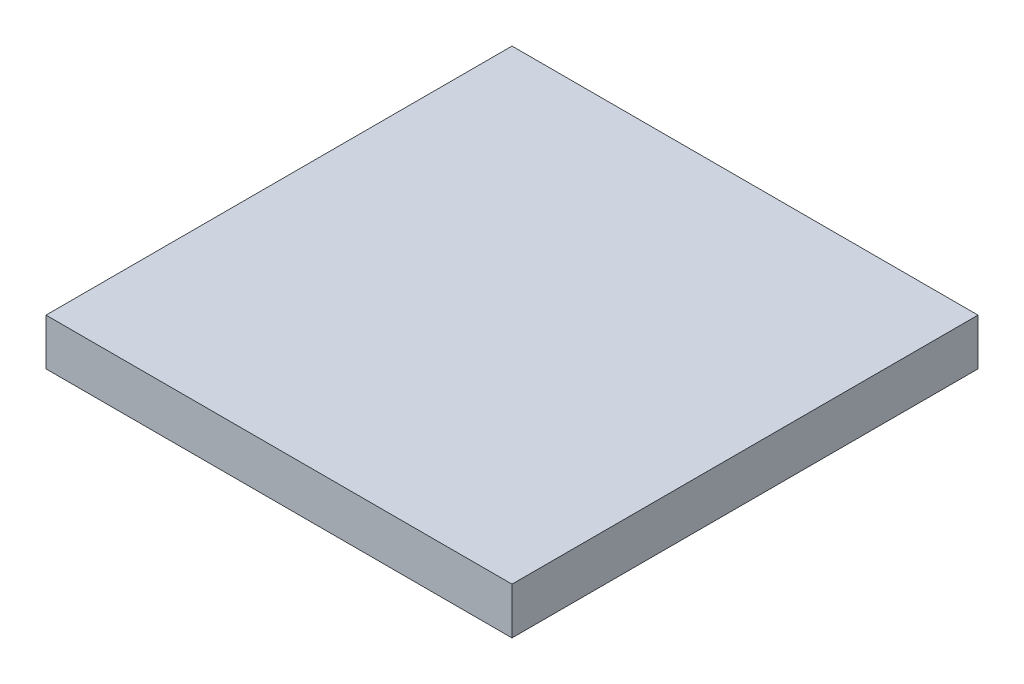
from build123d import *

# Parameters (mm, degrees)
SKETCH1_W      = 40
SKETCH1_H      = 40
EXTRUDE1_DEPTH = 4


with BuildPart() as part:
    # Sketch1 → Extrude1 (new body)
    with BuildSketch(Plane(origin=(0, 0, 0), x_dir=(1, 0, 0), z_dir=(0, 1, 0))):
        with Locations((20, 20)):
            Rectangle(SKETCH1_W, SKETCH1_H)
    extrude(amount=EXTRUDE1_DEPTH)


solid = part.part
